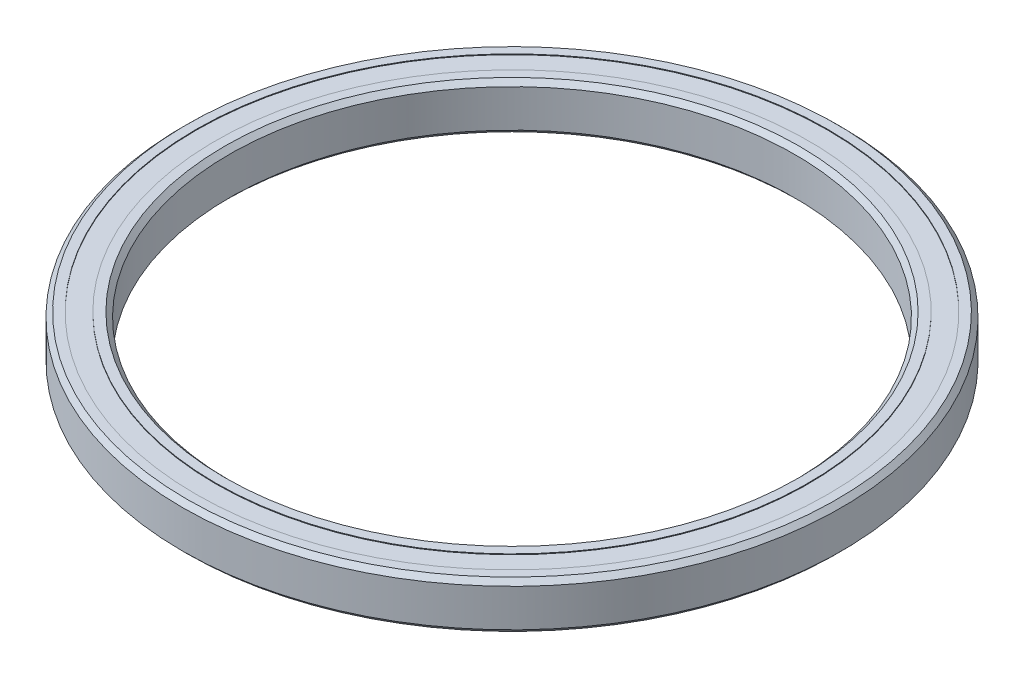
ISO-10303-21;
HEADER;
FILE_DESCRIPTION(('STEP AP214'),'2;1');
FILE_NAME('part.step','',(''),(''),'','','');
FILE_SCHEMA(('AUTOMOTIVE_DESIGN { 1 0 10303 214 1 1 1 1 }'));
ENDSEC;
DATA;
#1=APPLICATION_CONTEXT('core data for automotive mechanical design processes');
#2=APPLICATION_PROTOCOL_DEFINITION('international standard','automotive_design',2000,#1);
#3=PRODUCT_CONTEXT('',#1,'mechanical');
#4=PRODUCT('Part','Part','',(#3));
#5=PRODUCT_RELATED_PRODUCT_CATEGORY('part','',(#4));
#6=PRODUCT_DEFINITION_FORMATION('','',#4);
#7=PRODUCT_DEFINITION_CONTEXT('part definition',#1,'design');
#8=PRODUCT_DEFINITION('design','',#6,#7);
#9=PRODUCT_DEFINITION_SHAPE('','',#8);
#10=(LENGTH_UNIT() NAMED_UNIT(*) SI_UNIT(.MILLI.,.METRE.));
#11=(NAMED_UNIT(*) PLANE_ANGLE_UNIT() SI_UNIT($,.RADIAN.));
#12=(NAMED_UNIT(*) SI_UNIT($,.STERADIAN.) SOLID_ANGLE_UNIT());
#13=UNCERTAINTY_MEASURE_WITH_UNIT(LENGTH_MEASURE(1.E-05),#10,'distance_accuracy_value','');
#14=(GEOMETRIC_REPRESENTATION_CONTEXT(3) GLOBAL_UNCERTAINTY_ASSIGNED_CONTEXT((#13)) GLOBAL_UNIT_ASSIGNED_CONTEXT((#10,
#11,#12)) REPRESENTATION_CONTEXT('',''));
#15=CARTESIAN_POINT('',(0.,0.,0.));
#16=DIRECTION('',(0.,0.,1.));
#17=DIRECTION('',(1.,0.,0.));
#18=AXIS2_PLACEMENT_3D('',#15,#16,#17);
#19=CARTESIAN_POINT('',(0.,-3.175,0.));
#20=DIRECTION('',(0.,1.,0.));
#21=DIRECTION('',(0.,0.,1.));
#22=AXIS2_PLACEMENT_3D('',#19,#20,#21);
#23=PLANE('',#22);
#24=CARTESIAN_POINT('',(0.,-3.175,0.));
#25=DIRECTION('',(0.,1.,0.));
#26=DIRECTION('',(0.,0.,1.));
#27=AXIS2_PLACEMENT_3D('',#24,#25,#26);
#28=CIRCLE('',#27,43.815);
#29=CARTESIAN_POINT('',(0.,-3.175,43.815));
#30=VERTEX_POINT('',#29);
#31=EDGE_CURVE('E10',#30,#30,#28,.F.);
#32=ORIENTED_EDGE('',*,*,#31,.T.);
#33=EDGE_LOOP('',(#32));
#34=FACE_BOUND('',#33,.T.);
#35=CARTESIAN_POINT('',(0.,-3.175,0.));
#36=DIRECTION('',(0.,1.,0.));
#37=DIRECTION('',(0.,0.,1.));
#38=AXIS2_PLACEMENT_3D('',#35,#36,#37);
#39=CIRCLE('',#38,42.6212);
#40=CARTESIAN_POINT('',(0.,-3.175,42.6212));
#41=VERTEX_POINT('',#40);
#42=EDGE_CURVE('E79',#41,#41,#39,.T.);
#43=ORIENTED_EDGE('',*,*,#42,.T.);
#44=EDGE_LOOP('',(#43));
#45=FACE_BOUND('',#44,.T.);
#46=ADVANCED_FACE('F34',(#34,#45),#23,.F.);
#47=CARTESIAN_POINT('',(0.,3.175,0.));
#48=DIRECTION('',(0.,1.,0.));
#49=DIRECTION('',(0.,0.,1.));
#50=AXIS2_PLACEMENT_3D('',#47,#48,#49);
#51=PLANE('',#50);
#52=CARTESIAN_POINT('',(0.,3.175,0.));
#53=DIRECTION('',(0.,1.,0.));
#54=DIRECTION('',(0.,0.,1.));
#55=AXIS2_PLACEMENT_3D('',#52,#53,#54);
#56=CIRCLE('',#55,38.735);
#57=CARTESIAN_POINT('',(0.,3.175,38.735));
#58=VERTEX_POINT('',#57);
#59=EDGE_CURVE('E57',#58,#58,#56,.F.);
#60=ORIENTED_EDGE('',*,*,#59,.T.);
#61=EDGE_LOOP('',(#60));
#62=FACE_BOUND('',#61,.T.);
#63=CARTESIAN_POINT('',(0.,3.175,0.));
#64=DIRECTION('',(0.,1.,0.));
#65=DIRECTION('',(0.,0.,1.));
#66=AXIS2_PLACEMENT_3D('',#63,#64,#65);
#67=CIRCLE('',#66,39.9796);
#68=CARTESIAN_POINT('',(0.,3.175,39.9796));
#69=VERTEX_POINT('',#68);
#70=EDGE_CURVE('E73',#69,#69,#67,.T.);
#71=ORIENTED_EDGE('',*,*,#70,.T.);
#72=EDGE_LOOP('',(#71));
#73=FACE_BOUND('',#72,.T.);
#74=ADVANCED_FACE('F113',(#62,#73),#51,.T.);
#75=CARTESIAN_POINT('',(0.,3.175,0.));
#76=DIRECTION('',(0.,1.,0.));
#77=DIRECTION('',(0.,0.,1.));
#78=AXIS2_PLACEMENT_3D('',#75,#76,#77);
#79=CIRCLE('',#78,43.815);
#80=CARTESIAN_POINT('',(0.,3.175,43.815));
#81=VERTEX_POINT('',#80);
#82=EDGE_CURVE('E54',#81,#81,#79,.T.);
#83=ORIENTED_EDGE('',*,*,#82,.T.);
#84=EDGE_LOOP('',(#83));
#85=FACE_BOUND('',#84,.T.);
#86=CARTESIAN_POINT('',(0.,3.175,0.));
#87=DIRECTION('',(0.,1.,0.));
#88=DIRECTION('',(0.,0.,1.));
#89=AXIS2_PLACEMENT_3D('',#86,#87,#88);
#90=CIRCLE('',#89,42.6212);
#91=CARTESIAN_POINT('',(0.,3.175,42.6212));
#92=VERTEX_POINT('',#91);
#93=EDGE_CURVE('E67',#92,#92,#90,.T.);
#94=ORIENTED_EDGE('',*,*,#93,.F.);
#95=EDGE_LOOP('',(#94));
#96=FACE_BOUND('',#95,.T.);
#97=ADVANCED_FACE('F104',(#85,#96),#51,.T.);
#98=CARTESIAN_POINT('',(0.,-3.175,0.));
#99=DIRECTION('',(0.,1.,0.));
#100=DIRECTION('',(0.,0.,1.));
#101=AXIS2_PLACEMENT_3D('',#98,#99,#100);
#102=CIRCLE('',#101,38.735);
#103=CARTESIAN_POINT('',(0.,-3.175,38.735));
#104=VERTEX_POINT('',#103);
#105=EDGE_CURVE('E41',#104,#104,#102,.T.);
#106=ORIENTED_EDGE('',*,*,#105,.T.);
#107=EDGE_LOOP('',(#106));
#108=FACE_BOUND('',#107,.T.);
#109=CARTESIAN_POINT('',(0.,-3.175,0.));
#110=DIRECTION('',(0.,1.,0.));
#111=DIRECTION('',(0.,0.,1.));
#112=AXIS2_PLACEMENT_3D('',#109,#110,#111);
#113=CIRCLE('',#112,39.9796);
#114=CARTESIAN_POINT('',(0.,-3.175,39.9796));
#115=VERTEX_POINT('',#114);
#116=EDGE_CURVE('E85',#115,#115,#113,.T.);
#117=ORIENTED_EDGE('',*,*,#116,.F.);
#118=EDGE_LOOP('',(#117));
#119=FACE_BOUND('',#118,.T.);
#120=ADVANCED_FACE('F101',(#108,#119),#23,.F.);
#121=CARTESIAN_POINT('',(0.,3.175,0.));
#122=DIRECTION('',(0.,-1.,0.));
#123=DIRECTION('',(0.,0.,-1.));
#124=AXIS2_PLACEMENT_3D('',#121,#122,#123);
#125=CYLINDRICAL_SURFACE('',#124,44.45);
#126=CARTESIAN_POINT('',(0.,2.54000000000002,0.));
#127=DIRECTION('',(0.,1.,0.));
#128=DIRECTION('',(0.,0.,1.));
#129=AXIS2_PLACEMENT_3D('',#126,#127,#128);
#130=CIRCLE('',#129,44.45);
#131=CARTESIAN_POINT('',(0.,2.54000000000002,44.45));
#132=VERTEX_POINT('',#131);
#133=EDGE_CURVE('E45',#132,#132,#130,.F.);
#134=ORIENTED_EDGE('',*,*,#133,.T.);
#135=EDGE_LOOP('',(#134));
#136=FACE_BOUND('',#135,.T.);
#137=CARTESIAN_POINT('',(0.,-2.54,0.));
#138=DIRECTION('',(0.,1.,0.));
#139=DIRECTION('',(0.,0.,1.));
#140=AXIS2_PLACEMENT_3D('',#137,#138,#139);
#141=CIRCLE('',#140,44.45);
#142=CARTESIAN_POINT('',(0.,-2.54,44.45));
#143=VERTEX_POINT('',#142);
#144=EDGE_CURVE('E49',#143,#143,#141,.T.);
#145=ORIENTED_EDGE('',*,*,#144,.T.);
#146=EDGE_LOOP('',(#145));
#147=FACE_BOUND('',#146,.T.);
#148=ADVANCED_FACE('F103',(#136,#147),#125,.T.);
#149=CARTESIAN_POINT('',(0.,3.175,0.));
#150=DIRECTION('',(0.,-1.,0.));
#151=DIRECTION('',(0.,0.,-1.));
#152=AXIS2_PLACEMENT_3D('',#149,#150,#151);
#153=CYLINDRICAL_SURFACE('',#152,38.1);
#154=CARTESIAN_POINT('',(0.,2.53999999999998,0.));
#155=DIRECTION('',(0.,1.,0.));
#156=DIRECTION('',(0.,0.,1.));
#157=AXIS2_PLACEMENT_3D('',#154,#155,#156);
#158=CIRCLE('',#157,38.1);
#159=CARTESIAN_POINT('',(0.,2.53999999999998,38.1));
#160=VERTEX_POINT('',#159);
#161=EDGE_CURVE('E60',#160,#160,#158,.T.);
#162=ORIENTED_EDGE('',*,*,#161,.T.);
#163=EDGE_LOOP('',(#162));
#164=FACE_BOUND('',#163,.T.);
#165=CARTESIAN_POINT('',(0.,-2.54,0.));
#166=DIRECTION('',(0.,1.,0.));
#167=DIRECTION('',(0.,0.,1.));
#168=AXIS2_PLACEMENT_3D('',#165,#166,#167);
#169=CIRCLE('',#168,38.1);
#170=CARTESIAN_POINT('',(0.,-2.54,38.1));
#171=VERTEX_POINT('',#170);
#172=EDGE_CURVE('E63',#171,#171,#169,.F.);
#173=ORIENTED_EDGE('',*,*,#172,.T.);
#174=EDGE_LOOP('',(#173));
#175=FACE_BOUND('',#174,.T.);
#176=ADVANCED_FACE('F110',(#164,#175),#153,.F.);
#177=CARTESIAN_POINT('',(0.,3.075,0.));
#178=DIRECTION('',(0.,1.,0.));
#179=DIRECTION('',(0.,0.,1.));
#180=AXIS2_PLACEMENT_3D('',#177,#178,#179);
#181=CYLINDRICAL_SURFACE('',#180,42.6212);
#182=CARTESIAN_POINT('',(0.,3.075,0.));
#183=DIRECTION('',(0.,1.,0.));
#184=DIRECTION('',(0.,0.,1.));
#185=AXIS2_PLACEMENT_3D('',#182,#183,#184);
#186=CIRCLE('',#185,42.6212);
#187=CARTESIAN_POINT('',(0.,3.075,42.6212));
#188=VERTEX_POINT('',#187);
#189=EDGE_CURVE('E66',#188,#188,#186,.T.);
#190=ORIENTED_EDGE('',*,*,#189,.F.);
#191=EDGE_LOOP('',(#190));
#192=FACE_BOUND('',#191,.T.);
#193=ORIENTED_EDGE('',*,*,#93,.T.);
#194=EDGE_LOOP('',(#193));
#195=FACE_BOUND('',#194,.T.);
#196=ADVANCED_FACE('F140',(#192,#195),#181,.F.);
#197=CARTESIAN_POINT('',(0.,3.075,0.));
#198=DIRECTION('',(0.,1.,0.));
#199=DIRECTION('',(0.,0.,1.));
#200=AXIS2_PLACEMENT_3D('',#197,#198,#199);
#201=PLANE('',#200);
#202=CARTESIAN_POINT('',(0.,3.075,0.));
#203=DIRECTION('',(0.,1.,0.));
#204=DIRECTION('',(0.,0.,1.));
#205=AXIS2_PLACEMENT_3D('',#202,#203,#204);
#206=CIRCLE('',#205,39.9796);
#207=CARTESIAN_POINT('',(0.,3.075,39.9796));
#208=VERTEX_POINT('',#207);
#209=EDGE_CURVE('E70',#208,#208,#206,.T.);
#210=ORIENTED_EDGE('',*,*,#209,.F.);
#211=EDGE_LOOP('',(#210));
#212=FACE_BOUND('',#211,.T.);
#213=ORIENTED_EDGE('',*,*,#189,.T.);
#214=EDGE_LOOP('',(#213));
#215=FACE_BOUND('',#214,.T.);
#216=ADVANCED_FACE('F136',(#212,#215),#201,.T.);
#217=CARTESIAN_POINT('',(0.,3.075,0.));
#218=DIRECTION('',(0.,1.,0.));
#219=DIRECTION('',(0.,0.,1.));
#220=AXIS2_PLACEMENT_3D('',#217,#218,#219);
#221=CYLINDRICAL_SURFACE('',#220,39.9796);
#222=ORIENTED_EDGE('',*,*,#209,.T.);
#223=EDGE_LOOP('',(#222));
#224=FACE_BOUND('',#223,.T.);
#225=ORIENTED_EDGE('',*,*,#70,.F.);
#226=EDGE_LOOP('',(#225));
#227=FACE_BOUND('',#226,.T.);
#228=ADVANCED_FACE('F130',(#224,#227),#221,.T.);
#229=CARTESIAN_POINT('',(0.,-3.075,0.));
#230=DIRECTION('',(0.,-1.,0.));
#231=DIRECTION('',(0.,0.,1.));
#232=AXIS2_PLACEMENT_3D('',#229,#230,#231);
#233=PLANE('',#232);
#234=CARTESIAN_POINT('',(0.,-3.075,0.));
#235=DIRECTION('',(0.,1.,0.));
#236=DIRECTION('',(0.,0.,1.));
#237=AXIS2_PLACEMENT_3D('',#234,#235,#236);
#238=CIRCLE('',#237,42.6212);
#239=CARTESIAN_POINT('',(0.,-3.075,42.6212));
#240=VERTEX_POINT('',#239);
#241=EDGE_CURVE('E76',#240,#240,#238,.T.);
#242=ORIENTED_EDGE('',*,*,#241,.F.);
#243=EDGE_LOOP('',(#242));
#244=FACE_BOUND('',#243,.T.);
#245=CARTESIAN_POINT('',(0.,-3.075,0.));
#246=DIRECTION('',(0.,1.,0.));
#247=DIRECTION('',(0.,0.,1.));
#248=AXIS2_PLACEMENT_3D('',#245,#246,#247);
#249=CIRCLE('',#248,39.9796);
#250=CARTESIAN_POINT('',(0.,-3.075,39.9796));
#251=VERTEX_POINT('',#250);
#252=EDGE_CURVE('E82',#251,#251,#249,.T.);
#253=ORIENTED_EDGE('',*,*,#252,.T.);
#254=EDGE_LOOP('',(#253));
#255=FACE_BOUND('',#254,.T.);
#256=ADVANCED_FACE('F91',(#244,#255),#233,.T.);
#257=CARTESIAN_POINT('',(0.,-3.075,0.));
#258=DIRECTION('',(0.,-1.,0.));
#259=DIRECTION('',(0.,0.,-1.));
#260=AXIS2_PLACEMENT_3D('',#257,#258,#259);
#261=CYLINDRICAL_SURFACE('',#260,42.6212);
#262=ORIENTED_EDGE('',*,*,#241,.T.);
#263=EDGE_LOOP('',(#262));
#264=FACE_BOUND('',#263,.T.);
#265=ORIENTED_EDGE('',*,*,#42,.F.);
#266=EDGE_LOOP('',(#265));
#267=FACE_BOUND('',#266,.T.);
#268=ADVANCED_FACE('F97',(#264,#267),#261,.F.);
#269=CARTESIAN_POINT('',(0.,-3.075,0.));
#270=DIRECTION('',(0.,-1.,0.));
#271=DIRECTION('',(0.,0.,-1.));
#272=AXIS2_PLACEMENT_3D('',#269,#270,#271);
#273=CYLINDRICAL_SURFACE('',#272,39.9796);
#274=ORIENTED_EDGE('',*,*,#252,.F.);
#275=EDGE_LOOP('',(#274));
#276=FACE_BOUND('',#275,.T.);
#277=ORIENTED_EDGE('',*,*,#116,.T.);
#278=EDGE_LOOP('',(#277));
#279=FACE_BOUND('',#278,.T.);
#280=ADVANCED_FACE('F93',(#276,#279),#273,.T.);
#281=CARTESIAN_POINT('',(0.,2.53999999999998,0.));
#282=DIRECTION('',(0.,1.,0.));
#283=DIRECTION('',(0.,0.,1.));
#284=AXIS2_PLACEMENT_3D('',#281,#282,#283);
#285=CONICAL_SURFACE('',#284,38.1,0.785398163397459);
#286=ORIENTED_EDGE('',*,*,#59,.F.);
#287=EDGE_LOOP('',(#286));
#288=FACE_BOUND('',#287,.T.);
#289=ORIENTED_EDGE('',*,*,#161,.F.);
#290=EDGE_LOOP('',(#289));
#291=FACE_BOUND('',#290,.T.);
#292=ADVANCED_FACE('F96',(#288,#291),#285,.F.);
#293=CARTESIAN_POINT('',(0.,3.175,0.));
#294=DIRECTION('',(0.,-1.,0.));
#295=DIRECTION('',(0.,0.,-1.));
#296=AXIS2_PLACEMENT_3D('',#293,#294,#295);
#297=CONICAL_SURFACE('',#296,43.815,0.785398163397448);
#298=ORIENTED_EDGE('',*,*,#133,.F.);
#299=EDGE_LOOP('',(#298));
#300=FACE_BOUND('',#299,.T.);
#301=ORIENTED_EDGE('',*,*,#82,.F.);
#302=EDGE_LOOP('',(#301));
#303=FACE_BOUND('',#302,.T.);
#304=ADVANCED_FACE('F156',(#300,#303),#297,.T.);
#305=CARTESIAN_POINT('',(0.,-3.175,0.));
#306=DIRECTION('',(0.,-1.,0.));
#307=DIRECTION('',(0.,0.,-1.));
#308=AXIS2_PLACEMENT_3D('',#305,#306,#307);
#309=CONICAL_SURFACE('',#308,38.735,0.785398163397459);
#310=ORIENTED_EDGE('',*,*,#172,.F.);
#311=EDGE_LOOP('',(#310));
#312=FACE_BOUND('',#311,.T.);
#313=ORIENTED_EDGE('',*,*,#105,.F.);
#314=EDGE_LOOP('',(#313));
#315=FACE_BOUND('',#314,.T.);
#316=ADVANCED_FACE('F153',(#312,#315),#309,.F.);
#317=CARTESIAN_POINT('',(0.,-2.54,0.));
#318=DIRECTION('',(0.,1.,0.));
#319=DIRECTION('',(0.,0.,1.));
#320=AXIS2_PLACEMENT_3D('',#317,#318,#319);
#321=CONICAL_SURFACE('',#320,44.45,0.785398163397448);
#322=ORIENTED_EDGE('',*,*,#31,.F.);
#323=EDGE_LOOP('',(#322));
#324=FACE_BOUND('',#323,.T.);
#325=ORIENTED_EDGE('',*,*,#144,.F.);
#326=EDGE_LOOP('',(#325));
#327=FACE_BOUND('',#326,.T.);
#328=ADVANCED_FACE('F36',(#324,#327),#321,.T.);
#329=CLOSED_SHELL('',(#46,#74,#97,#120,#148,#176,#196,#216,#228,#256,#268,#280,#292,#304,#316,#328));
#330=MANIFOLD_SOLID_BREP('B2',#329);
#331=ADVANCED_BREP_SHAPE_REPRESENTATION('',(#18,#330),#14);
#332=SHAPE_DEFINITION_REPRESENTATION(#9,#331);
ENDSEC;
END-ISO-10303-21;
